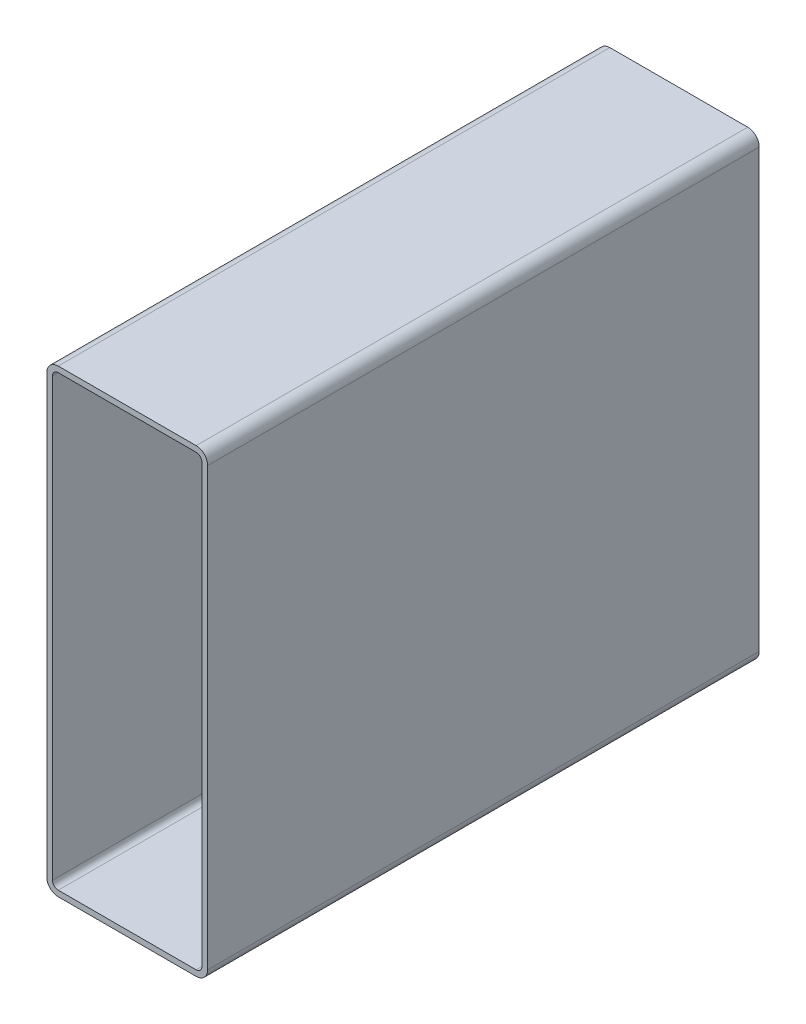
ISO-10303-21;
HEADER;
FILE_DESCRIPTION(('STEP AP214'),'2;1');
FILE_NAME('part.step','',(''),(''),'','','');
FILE_SCHEMA(('AUTOMOTIVE_DESIGN { 1 0 10303 214 1 1 1 1 }'));
ENDSEC;
DATA;
#1=APPLICATION_CONTEXT('core data for automotive mechanical design processes');
#2=APPLICATION_PROTOCOL_DEFINITION('international standard','automotive_design',2000,#1);
#3=PRODUCT_CONTEXT('',#1,'mechanical');
#4=PRODUCT('Part','Part','',(#3));
#5=PRODUCT_RELATED_PRODUCT_CATEGORY('part','',(#4));
#6=PRODUCT_DEFINITION_FORMATION('','',#4);
#7=PRODUCT_DEFINITION_CONTEXT('part definition',#1,'design');
#8=PRODUCT_DEFINITION('design','',#6,#7);
#9=PRODUCT_DEFINITION_SHAPE('','',#8);
#10=(LENGTH_UNIT() NAMED_UNIT(*) SI_UNIT(.MILLI.,.METRE.));
#11=(NAMED_UNIT(*) PLANE_ANGLE_UNIT() SI_UNIT($,.RADIAN.));
#12=(NAMED_UNIT(*) SI_UNIT($,.STERADIAN.) SOLID_ANGLE_UNIT());
#13=UNCERTAINTY_MEASURE_WITH_UNIT(LENGTH_MEASURE(1.E-05),#10,'distance_accuracy_value','');
#14=(GEOMETRIC_REPRESENTATION_CONTEXT(3) GLOBAL_UNCERTAINTY_ASSIGNED_CONTEXT((#13)) GLOBAL_UNIT_ASSIGNED_CONTEXT((#10,
#11,#12)) REPRESENTATION_CONTEXT('',''));
#15=CARTESIAN_POINT('',(0.,0.,0.));
#16=DIRECTION('',(0.,0.,1.));
#17=DIRECTION('',(1.,0.,0.));
#18=AXIS2_PLACEMENT_3D('',#15,#16,#17);
#19=CARTESIAN_POINT('',(8.43214692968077,249.570313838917,304.8));
#20=DIRECTION('',(0.,0.,1.));
#21=DIRECTION('',(1.,0.,0.));
#22=AXIS2_PLACEMENT_3D('',#19,#20,#21);
#23=PLANE('',#22);
#24=CARTESIAN_POINT('',(8.43214692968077,249.570313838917,304.8));
#25=DIRECTION('',(0.,0.,1.));
#26=DIRECTION('',(1.,0.,0.));
#27=AXIS2_PLACEMENT_3D('',#24,#25,#26);
#28=CIRCLE('',#27,6.35000000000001);
#29=CARTESIAN_POINT('',(8.43214692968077,255.920313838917,304.8));
#30=VERTEX_POINT('',#29);
#31=CARTESIAN_POINT('',(2.08214692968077,249.570313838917,304.8));
#32=VERTEX_POINT('',#31);
#33=EDGE_CURVE('E211',#30,#32,#28,.T.);
#34=ORIENTED_EDGE('',*,*,#33,.T.);
#35=DIRECTION('',(0.,-1.,0.));
#36=VECTOR('',#35,1.);
#37=CARTESIAN_POINT('',(2.08214692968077,8.27031383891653,304.8));
#38=LINE('',#37,#36);
#39=CARTESIAN_POINT('',(2.08214692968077,8.27031383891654,304.8));
#40=VERTEX_POINT('',#39);
#41=EDGE_CURVE('E214',#32,#40,#38,.T.);
#42=ORIENTED_EDGE('',*,*,#41,.T.);
#43=CARTESIAN_POINT('',(8.43214692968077,8.27031383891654,304.8));
#44=DIRECTION('',(0.,0.,1.));
#45=DIRECTION('',(1.,0.,0.));
#46=AXIS2_PLACEMENT_3D('',#43,#44,#45);
#47=CIRCLE('',#46,6.35);
#48=CARTESIAN_POINT('',(8.43214692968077,1.92031383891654,304.8));
#49=VERTEX_POINT('',#48);
#50=EDGE_CURVE('E217',#40,#49,#47,.T.);
#51=ORIENTED_EDGE('',*,*,#50,.T.);
#52=DIRECTION('',(1.,0.,0.));
#53=VECTOR('',#52,1.);
#54=CARTESIAN_POINT('',(84.6321469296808,1.92031383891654,304.8));
#55=LINE('',#54,#53);
#56=CARTESIAN_POINT('',(84.6321469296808,1.92031383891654,304.8));
#57=VERTEX_POINT('',#56);
#58=EDGE_CURVE('E219',#49,#57,#55,.T.);
#59=ORIENTED_EDGE('',*,*,#58,.T.);
#60=CARTESIAN_POINT('',(84.6321469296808,8.27031383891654,304.8));
#61=DIRECTION('',(0.,0.,1.));
#62=DIRECTION('',(1.,0.,0.));
#63=AXIS2_PLACEMENT_3D('',#60,#61,#62);
#64=CIRCLE('',#63,6.35);
#65=CARTESIAN_POINT('',(90.9821469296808,8.27031383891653,304.8));
#66=VERTEX_POINT('',#65);
#67=EDGE_CURVE('E221',#57,#66,#64,.T.);
#68=ORIENTED_EDGE('',*,*,#67,.T.);
#69=DIRECTION('',(0.,1.,0.));
#70=VECTOR('',#69,1.);
#71=CARTESIAN_POINT('',(90.9821469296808,249.570313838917,304.8));
#72=LINE('',#71,#70);
#73=CARTESIAN_POINT('',(90.9821469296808,249.570313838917,304.8));
#74=VERTEX_POINT('',#73);
#75=EDGE_CURVE('E223',#66,#74,#72,.T.);
#76=ORIENTED_EDGE('',*,*,#75,.T.);
#77=CARTESIAN_POINT('',(84.6321469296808,249.570313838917,304.8));
#78=DIRECTION('',(0.,0.,1.));
#79=DIRECTION('',(1.,0.,0.));
#80=AXIS2_PLACEMENT_3D('',#77,#78,#79);
#81=CIRCLE('',#80,6.35000000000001);
#82=CARTESIAN_POINT('',(84.6321469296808,255.920313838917,304.8));
#83=VERTEX_POINT('',#82);
#84=EDGE_CURVE('E225',#74,#83,#81,.T.);
#85=ORIENTED_EDGE('',*,*,#84,.T.);
#86=DIRECTION('',(-1.,0.,0.));
#87=VECTOR('',#86,1.);
#88=CARTESIAN_POINT('',(8.43214692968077,255.920313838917,304.8));
#89=LINE('',#88,#87);
#90=EDGE_CURVE('E227',#83,#30,#89,.T.);
#91=ORIENTED_EDGE('',*,*,#90,.T.);
#92=EDGE_LOOP('',(#34,#42,#51,#59,#68,#76,#85,#91));
#93=FACE_BOUND('',#92,.T.);
#94=DIRECTION('',(0.,-1.,0.));
#95=VECTOR('',#94,1.);
#96=CARTESIAN_POINT('',(5.25714692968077,8.27031383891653,304.8));
#97=LINE('',#96,#95);
#98=CARTESIAN_POINT('',(5.25714692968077,249.570313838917,304.8));
#99=VERTEX_POINT('',#98);
#100=CARTESIAN_POINT('',(5.25714692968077,8.27031383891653,304.8));
#101=VERTEX_POINT('',#100);
#102=EDGE_CURVE('E154',#99,#101,#97,.T.);
#103=ORIENTED_EDGE('',*,*,#102,.F.);
#104=CARTESIAN_POINT('',(8.43214692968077,249.570313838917,304.8));
#105=DIRECTION('',(0.,0.,1.));
#106=DIRECTION('',(1.,0.,0.));
#107=AXIS2_PLACEMENT_3D('',#104,#105,#106);
#108=CIRCLE('',#107,3.17499999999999);
#109=CARTESIAN_POINT('',(8.43214692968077,252.745313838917,304.8));
#110=VERTEX_POINT('',#109);
#111=EDGE_CURVE('E146',#110,#99,#108,.T.);
#112=ORIENTED_EDGE('',*,*,#111,.F.);
#113=DIRECTION('',(-1.,0.,0.));
#114=VECTOR('',#113,1.);
#115=CARTESIAN_POINT('',(8.43214692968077,252.745313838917,304.8));
#116=LINE('',#115,#114);
#117=CARTESIAN_POINT('',(84.6321469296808,252.745313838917,304.8));
#118=VERTEX_POINT('',#117);
#119=EDGE_CURVE('E179',#118,#110,#116,.T.);
#120=ORIENTED_EDGE('',*,*,#119,.F.);
#121=CARTESIAN_POINT('',(84.6321469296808,249.570313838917,304.8));
#122=DIRECTION('',(0.,0.,1.));
#123=DIRECTION('',(1.,0.,0.));
#124=AXIS2_PLACEMENT_3D('',#121,#122,#123);
#125=CIRCLE('',#124,3.17499999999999);
#126=CARTESIAN_POINT('',(87.8071469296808,249.570313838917,304.8));
#127=VERTEX_POINT('',#126);
#128=EDGE_CURVE('E177',#127,#118,#125,.T.);
#129=ORIENTED_EDGE('',*,*,#128,.F.);
#130=DIRECTION('',(0.,1.,0.));
#131=VECTOR('',#130,1.);
#132=CARTESIAN_POINT('',(87.8071469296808,249.570313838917,304.8));
#133=LINE('',#132,#131);
#134=CARTESIAN_POINT('',(87.8071469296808,8.27031383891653,304.8));
#135=VERTEX_POINT('',#134);
#136=EDGE_CURVE('E175',#135,#127,#133,.T.);
#137=ORIENTED_EDGE('',*,*,#136,.F.);
#138=CARTESIAN_POINT('',(84.6321469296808,8.27031383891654,304.8));
#139=DIRECTION('',(0.,0.,1.));
#140=DIRECTION('',(1.,0.,0.));
#141=AXIS2_PLACEMENT_3D('',#138,#139,#140);
#142=CIRCLE('',#141,3.175);
#143=CARTESIAN_POINT('',(84.6321469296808,5.09531383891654,304.8));
#144=VERTEX_POINT('',#143);
#145=EDGE_CURVE('E173',#144,#135,#142,.T.);
#146=ORIENTED_EDGE('',*,*,#145,.F.);
#147=DIRECTION('',(1.,0.,0.));
#148=VECTOR('',#147,1.);
#149=CARTESIAN_POINT('',(84.6321469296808,5.09531383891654,304.8));
#150=LINE('',#149,#148);
#151=CARTESIAN_POINT('',(8.43214692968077,5.09531383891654,304.8));
#152=VERTEX_POINT('',#151);
#153=EDGE_CURVE('E169',#152,#144,#150,.T.);
#154=ORIENTED_EDGE('',*,*,#153,.F.);
#155=CARTESIAN_POINT('',(8.43214692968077,8.27031383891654,304.8));
#156=DIRECTION('',(0.,0.,1.));
#157=DIRECTION('',(1.,0.,0.));
#158=AXIS2_PLACEMENT_3D('',#155,#156,#157);
#159=CIRCLE('',#158,3.175);
#160=EDGE_CURVE('E167',#101,#152,#159,.T.);
#161=ORIENTED_EDGE('',*,*,#160,.F.);
#162=EDGE_LOOP('',(#103,#112,#120,#129,#137,#146,#154,#161));
#163=FACE_BOUND('',#162,.T.);
#164=ADVANCED_FACE('F33',(#93,#163),#23,.T.);
#165=CARTESIAN_POINT('',(8.43214692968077,249.570313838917,0.));
#166=DIRECTION('',(0.,0.,1.));
#167=DIRECTION('',(1.,0.,0.));
#168=AXIS2_PLACEMENT_3D('',#165,#166,#167);
#169=PLANE('',#168);
#170=CARTESIAN_POINT('',(8.43214692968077,249.570313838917,0.));
#171=DIRECTION('',(0.,0.,1.));
#172=DIRECTION('',(1.,0.,0.));
#173=AXIS2_PLACEMENT_3D('',#170,#171,#172);
#174=CIRCLE('',#173,6.35000000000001);
#175=CARTESIAN_POINT('',(8.43214692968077,255.920313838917,0.));
#176=VERTEX_POINT('',#175);
#177=CARTESIAN_POINT('',(2.08214692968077,249.570313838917,0.));
#178=VERTEX_POINT('',#177);
#179=EDGE_CURVE('E162',#176,#178,#174,.T.);
#180=ORIENTED_EDGE('',*,*,#179,.F.);
#181=DIRECTION('',(-1.,0.,0.));
#182=VECTOR('',#181,1.);
#183=CARTESIAN_POINT('',(8.43214692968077,255.920313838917,0.));
#184=LINE('',#183,#182);
#185=CARTESIAN_POINT('',(84.6321469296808,255.920313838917,0.));
#186=VERTEX_POINT('',#185);
#187=EDGE_CURVE('E215',#186,#176,#184,.T.);
#188=ORIENTED_EDGE('',*,*,#187,.F.);
#189=CARTESIAN_POINT('',(84.6321469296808,249.570313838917,0.));
#190=DIRECTION('',(0.,0.,1.));
#191=DIRECTION('',(1.,0.,0.));
#192=AXIS2_PLACEMENT_3D('',#189,#190,#191);
#193=CIRCLE('',#192,6.35000000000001);
#194=CARTESIAN_POINT('',(90.9821469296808,249.570313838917,0.));
#195=VERTEX_POINT('',#194);
#196=EDGE_CURVE('E242',#195,#186,#193,.T.);
#197=ORIENTED_EDGE('',*,*,#196,.F.);
#198=DIRECTION('',(0.,1.,0.));
#199=VECTOR('',#198,1.);
#200=CARTESIAN_POINT('',(90.9821469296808,249.570313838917,0.));
#201=LINE('',#200,#199);
#202=CARTESIAN_POINT('',(90.9821469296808,8.27031383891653,0.));
#203=VERTEX_POINT('',#202);
#204=EDGE_CURVE('E240',#203,#195,#201,.T.);
#205=ORIENTED_EDGE('',*,*,#204,.F.);
#206=CARTESIAN_POINT('',(84.6321469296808,8.27031383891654,0.));
#207=DIRECTION('',(0.,0.,1.));
#208=DIRECTION('',(1.,0.,0.));
#209=AXIS2_PLACEMENT_3D('',#206,#207,#208);
#210=CIRCLE('',#209,6.35);
#211=CARTESIAN_POINT('',(84.6321469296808,1.92031383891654,0.));
#212=VERTEX_POINT('',#211);
#213=EDGE_CURVE('E238',#212,#203,#210,.T.);
#214=ORIENTED_EDGE('',*,*,#213,.F.);
#215=DIRECTION('',(1.,0.,0.));
#216=VECTOR('',#215,1.);
#217=CARTESIAN_POINT('',(84.6321469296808,1.92031383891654,0.));
#218=LINE('',#217,#216);
#219=CARTESIAN_POINT('',(8.43214692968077,1.92031383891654,0.));
#220=VERTEX_POINT('',#219);
#221=EDGE_CURVE('E236',#220,#212,#218,.T.);
#222=ORIENTED_EDGE('',*,*,#221,.F.);
#223=CARTESIAN_POINT('',(8.43214692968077,8.27031383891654,0.));
#224=DIRECTION('',(0.,0.,1.));
#225=DIRECTION('',(1.,0.,0.));
#226=AXIS2_PLACEMENT_3D('',#223,#224,#225);
#227=CIRCLE('',#226,6.35);
#228=CARTESIAN_POINT('',(2.08214692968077,8.27031383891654,0.));
#229=VERTEX_POINT('',#228);
#230=EDGE_CURVE('E234',#229,#220,#227,.T.);
#231=ORIENTED_EDGE('',*,*,#230,.F.);
#232=DIRECTION('',(0.,-1.,0.));
#233=VECTOR('',#232,1.);
#234=CARTESIAN_POINT('',(2.08214692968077,8.27031383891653,0.));
#235=LINE('',#234,#233);
#236=EDGE_CURVE('E232',#178,#229,#235,.T.);
#237=ORIENTED_EDGE('',*,*,#236,.F.);
#238=EDGE_LOOP('',(#180,#188,#197,#205,#214,#222,#231,#237));
#239=FACE_BOUND('',#238,.T.);
#240=CARTESIAN_POINT('',(8.43214692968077,249.570313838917,0.));
#241=DIRECTION('',(0.,0.,1.));
#242=DIRECTION('',(1.,0.,0.));
#243=AXIS2_PLACEMENT_3D('',#240,#241,#242);
#244=CIRCLE('',#243,3.17499999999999);
#245=CARTESIAN_POINT('',(8.43214692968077,252.745313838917,0.));
#246=VERTEX_POINT('',#245);
#247=CARTESIAN_POINT('',(5.25714692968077,249.570313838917,0.));
#248=VERTEX_POINT('',#247);
#249=EDGE_CURVE('E56',#246,#248,#244,.T.);
#250=ORIENTED_EDGE('',*,*,#249,.T.);
#251=DIRECTION('',(0.,-1.,0.));
#252=VECTOR('',#251,1.);
#253=CARTESIAN_POINT('',(5.25714692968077,8.27031383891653,0.));
#254=LINE('',#253,#252);
#255=CARTESIAN_POINT('',(5.25714692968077,8.27031383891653,0.));
#256=VERTEX_POINT('',#255);
#257=EDGE_CURVE('E161',#248,#256,#254,.T.);
#258=ORIENTED_EDGE('',*,*,#257,.T.);
#259=CARTESIAN_POINT('',(8.43214692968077,8.27031383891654,0.));
#260=DIRECTION('',(0.,0.,1.));
#261=DIRECTION('',(1.,0.,0.));
#262=AXIS2_PLACEMENT_3D('',#259,#260,#261);
#263=CIRCLE('',#262,3.175);
#264=CARTESIAN_POINT('',(8.43214692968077,5.09531383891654,0.));
#265=VERTEX_POINT('',#264);
#266=EDGE_CURVE('E183',#256,#265,#263,.T.);
#267=ORIENTED_EDGE('',*,*,#266,.T.);
#268=DIRECTION('',(1.,0.,0.));
#269=VECTOR('',#268,1.);
#270=CARTESIAN_POINT('',(84.6321469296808,5.09531383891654,0.));
#271=LINE('',#270,#269);
#272=CARTESIAN_POINT('',(84.6321469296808,5.09531383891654,0.));
#273=VERTEX_POINT('',#272);
#274=EDGE_CURVE('E186',#265,#273,#271,.T.);
#275=ORIENTED_EDGE('',*,*,#274,.T.);
#276=CARTESIAN_POINT('',(84.6321469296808,8.27031383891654,0.));
#277=DIRECTION('',(0.,0.,1.));
#278=DIRECTION('',(1.,0.,0.));
#279=AXIS2_PLACEMENT_3D('',#276,#277,#278);
#280=CIRCLE('',#279,3.175);
#281=CARTESIAN_POINT('',(87.8071469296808,8.27031383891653,0.));
#282=VERTEX_POINT('',#281);
#283=EDGE_CURVE('E189',#273,#282,#280,.T.);
#284=ORIENTED_EDGE('',*,*,#283,.T.);
#285=DIRECTION('',(0.,1.,0.));
#286=VECTOR('',#285,1.);
#287=CARTESIAN_POINT('',(87.8071469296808,249.570313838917,0.));
#288=LINE('',#287,#286);
#289=CARTESIAN_POINT('',(87.8071469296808,249.570313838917,0.));
#290=VERTEX_POINT('',#289);
#291=EDGE_CURVE('E192',#282,#290,#288,.T.);
#292=ORIENTED_EDGE('',*,*,#291,.T.);
#293=CARTESIAN_POINT('',(84.6321469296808,249.570313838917,0.));
#294=DIRECTION('',(0.,0.,1.));
#295=DIRECTION('',(1.,0.,0.));
#296=AXIS2_PLACEMENT_3D('',#293,#294,#295);
#297=CIRCLE('',#296,3.17499999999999);
#298=CARTESIAN_POINT('',(84.6321469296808,252.745313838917,0.));
#299=VERTEX_POINT('',#298);
#300=EDGE_CURVE('E195',#290,#299,#297,.T.);
#301=ORIENTED_EDGE('',*,*,#300,.T.);
#302=DIRECTION('',(-1.,0.,0.));
#303=VECTOR('',#302,1.);
#304=CARTESIAN_POINT('',(8.43214692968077,252.745313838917,0.));
#305=LINE('',#304,#303);
#306=EDGE_CURVE('E155',#299,#246,#305,.T.);
#307=ORIENTED_EDGE('',*,*,#306,.T.);
#308=EDGE_LOOP('',(#250,#258,#267,#275,#284,#292,#301,#307));
#309=FACE_BOUND('',#308,.T.);
#310=ADVANCED_FACE('F272',(#239,#309),#169,.F.);
#311=CARTESIAN_POINT('',(8.43214692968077,249.570313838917,304.8));
#312=DIRECTION('',(0.,0.,-1.));
#313=DIRECTION('',(-1.,0.,0.));
#314=AXIS2_PLACEMENT_3D('',#311,#312,#313);
#315=CYLINDRICAL_SURFACE('',#314,6.35000000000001);
#316=ORIENTED_EDGE('',*,*,#179,.T.);
#317=DIRECTION('',(0.,0.,-1.));
#318=VECTOR('',#317,1.);
#319=CARTESIAN_POINT('',(2.08214692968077,249.570313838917,304.8));
#320=LINE('',#319,#318);
#321=EDGE_CURVE('E11',#32,#178,#320,.T.);
#322=ORIENTED_EDGE('',*,*,#321,.F.);
#323=ORIENTED_EDGE('',*,*,#33,.F.);
#324=DIRECTION('',(0.,0.,-1.));
#325=VECTOR('',#324,1.);
#326=CARTESIAN_POINT('',(8.43214692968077,255.920313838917,304.8));
#327=LINE('',#326,#325);
#328=EDGE_CURVE('E229',#30,#176,#327,.T.);
#329=ORIENTED_EDGE('',*,*,#328,.T.);
#330=EDGE_LOOP('',(#316,#322,#323,#329));
#331=FACE_BOUND('',#330,.T.);
#332=ADVANCED_FACE('F35',(#331),#315,.T.);
#333=CARTESIAN_POINT('',(2.08214692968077,8.27031383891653,304.8));
#334=DIRECTION('',(1.,0.,0.));
#335=DIRECTION('',(0.,0.,-1.));
#336=AXIS2_PLACEMENT_3D('',#333,#334,#335);
#337=PLANE('',#336);
#338=ORIENTED_EDGE('',*,*,#236,.T.);
#339=DIRECTION('',(0.,0.,-1.));
#340=VECTOR('',#339,1.);
#341=CARTESIAN_POINT('',(2.08214692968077,8.27031383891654,304.8));
#342=LINE('',#341,#340);
#343=EDGE_CURVE('E41',#40,#229,#342,.T.);
#344=ORIENTED_EDGE('',*,*,#343,.F.);
#345=ORIENTED_EDGE('',*,*,#41,.F.);
#346=ORIENTED_EDGE('',*,*,#321,.T.);
#347=EDGE_LOOP('',(#338,#344,#345,#346));
#348=FACE_BOUND('',#347,.T.);
#349=ADVANCED_FACE('F289',(#348),#337,.F.);
#350=CARTESIAN_POINT('',(8.43214692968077,8.27031383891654,304.8));
#351=DIRECTION('',(0.,0.,-1.));
#352=DIRECTION('',(-1.,0.,0.));
#353=AXIS2_PLACEMENT_3D('',#350,#351,#352);
#354=CYLINDRICAL_SURFACE('',#353,6.35);
#355=ORIENTED_EDGE('',*,*,#230,.T.);
#356=DIRECTION('',(0.,0.,-1.));
#357=VECTOR('',#356,1.);
#358=CARTESIAN_POINT('',(8.43214692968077,1.92031383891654,304.8));
#359=LINE('',#358,#357);
#360=EDGE_CURVE('E259',#49,#220,#359,.T.);
#361=ORIENTED_EDGE('',*,*,#360,.F.);
#362=ORIENTED_EDGE('',*,*,#50,.F.);
#363=ORIENTED_EDGE('',*,*,#343,.T.);
#364=EDGE_LOOP('',(#355,#361,#362,#363));
#365=FACE_BOUND('',#364,.T.);
#366=ADVANCED_FACE('F266',(#365),#354,.T.);
#367=CARTESIAN_POINT('',(84.6321469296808,1.92031383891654,304.8));
#368=DIRECTION('',(0.,1.,0.));
#369=DIRECTION('',(0.,0.,1.));
#370=AXIS2_PLACEMENT_3D('',#367,#368,#369);
#371=PLANE('',#370);
#372=ORIENTED_EDGE('',*,*,#221,.T.);
#373=DIRECTION('',(0.,0.,-1.));
#374=VECTOR('',#373,1.);
#375=CARTESIAN_POINT('',(84.6321469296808,1.92031383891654,304.8));
#376=LINE('',#375,#374);
#377=EDGE_CURVE('E256',#57,#212,#376,.T.);
#378=ORIENTED_EDGE('',*,*,#377,.F.);
#379=ORIENTED_EDGE('',*,*,#58,.F.);
#380=ORIENTED_EDGE('',*,*,#360,.T.);
#381=EDGE_LOOP('',(#372,#378,#379,#380));
#382=FACE_BOUND('',#381,.T.);
#383=ADVANCED_FACE('F278',(#382),#371,.F.);
#384=CARTESIAN_POINT('',(84.6321469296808,8.27031383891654,304.8));
#385=DIRECTION('',(0.,0.,-1.));
#386=DIRECTION('',(-1.,0.,0.));
#387=AXIS2_PLACEMENT_3D('',#384,#385,#386);
#388=CYLINDRICAL_SURFACE('',#387,6.35);
#389=ORIENTED_EDGE('',*,*,#213,.T.);
#390=DIRECTION('',(0.,0.,-1.));
#391=VECTOR('',#390,1.);
#392=CARTESIAN_POINT('',(90.9821469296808,8.27031383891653,304.8));
#393=LINE('',#392,#391);
#394=EDGE_CURVE('E253',#66,#203,#393,.T.);
#395=ORIENTED_EDGE('',*,*,#394,.F.);
#396=ORIENTED_EDGE('',*,*,#67,.F.);
#397=ORIENTED_EDGE('',*,*,#377,.T.);
#398=EDGE_LOOP('',(#389,#395,#396,#397));
#399=FACE_BOUND('',#398,.T.);
#400=ADVANCED_FACE('F282',(#399),#388,.T.);
#401=CARTESIAN_POINT('',(90.9821469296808,249.570313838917,304.8));
#402=DIRECTION('',(-1.,0.,0.));
#403=DIRECTION('',(0.,0.,1.));
#404=AXIS2_PLACEMENT_3D('',#401,#402,#403);
#405=PLANE('',#404);
#406=ORIENTED_EDGE('',*,*,#204,.T.);
#407=DIRECTION('',(0.,0.,-1.));
#408=VECTOR('',#407,1.);
#409=CARTESIAN_POINT('',(90.9821469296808,249.570313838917,304.8));
#410=LINE('',#409,#408);
#411=EDGE_CURVE('E250',#74,#195,#410,.T.);
#412=ORIENTED_EDGE('',*,*,#411,.F.);
#413=ORIENTED_EDGE('',*,*,#75,.F.);
#414=ORIENTED_EDGE('',*,*,#394,.T.);
#415=EDGE_LOOP('',(#406,#412,#413,#414));
#416=FACE_BOUND('',#415,.T.);
#417=ADVANCED_FACE('F302',(#416),#405,.F.);
#418=CARTESIAN_POINT('',(84.6321469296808,249.570313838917,304.8));
#419=DIRECTION('',(0.,0.,-1.));
#420=DIRECTION('',(-1.,0.,0.));
#421=AXIS2_PLACEMENT_3D('',#418,#419,#420);
#422=CYLINDRICAL_SURFACE('',#421,6.35000000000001);
#423=ORIENTED_EDGE('',*,*,#196,.T.);
#424=DIRECTION('',(0.,0.,-1.));
#425=VECTOR('',#424,1.);
#426=CARTESIAN_POINT('',(84.6321469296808,255.920313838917,304.8));
#427=LINE('',#426,#425);
#428=EDGE_CURVE('E247',#83,#186,#427,.T.);
#429=ORIENTED_EDGE('',*,*,#428,.F.);
#430=ORIENTED_EDGE('',*,*,#84,.F.);
#431=ORIENTED_EDGE('',*,*,#411,.T.);
#432=EDGE_LOOP('',(#423,#429,#430,#431));
#433=FACE_BOUND('',#432,.T.);
#434=ADVANCED_FACE('F300',(#433),#422,.T.);
#435=CARTESIAN_POINT('',(8.43214692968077,255.920313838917,304.8));
#436=DIRECTION('',(0.,-1.,0.));
#437=DIRECTION('',(0.,0.,-1.));
#438=AXIS2_PLACEMENT_3D('',#435,#436,#437);
#439=PLANE('',#438);
#440=ORIENTED_EDGE('',*,*,#187,.T.);
#441=ORIENTED_EDGE('',*,*,#328,.F.);
#442=ORIENTED_EDGE('',*,*,#90,.F.);
#443=ORIENTED_EDGE('',*,*,#428,.T.);
#444=EDGE_LOOP('',(#440,#441,#442,#443));
#445=FACE_BOUND('',#444,.T.);
#446=ADVANCED_FACE('F295',(#445),#439,.F.);
#447=CARTESIAN_POINT('',(8.43214692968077,249.570313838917,304.8));
#448=DIRECTION('',(0.,0.,-1.));
#449=DIRECTION('',(-1.,0.,0.));
#450=AXIS2_PLACEMENT_3D('',#447,#448,#449);
#451=CYLINDRICAL_SURFACE('',#450,3.17499999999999);
#452=ORIENTED_EDGE('',*,*,#249,.F.);
#453=DIRECTION('',(0.,0.,-1.));
#454=VECTOR('',#453,1.);
#455=CARTESIAN_POINT('',(8.43214692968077,252.745313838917,304.8));
#456=LINE('',#455,#454);
#457=EDGE_CURVE('E150',#110,#246,#456,.T.);
#458=ORIENTED_EDGE('',*,*,#457,.F.);
#459=ORIENTED_EDGE('',*,*,#111,.T.);
#460=DIRECTION('',(0.,0.,-1.));
#461=VECTOR('',#460,1.);
#462=CARTESIAN_POINT('',(5.25714692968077,249.570313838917,304.8));
#463=LINE('',#462,#461);
#464=EDGE_CURVE('E149',#99,#248,#463,.T.);
#465=ORIENTED_EDGE('',*,*,#464,.T.);
#466=EDGE_LOOP('',(#452,#458,#459,#465));
#467=FACE_BOUND('',#466,.T.);
#468=ADVANCED_FACE('F148',(#467),#451,.F.);
#469=CARTESIAN_POINT('',(5.25714692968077,8.27031383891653,304.8));
#470=DIRECTION('',(1.,0.,0.));
#471=DIRECTION('',(0.,0.,-1.));
#472=AXIS2_PLACEMENT_3D('',#469,#470,#471);
#473=PLANE('',#472);
#474=ORIENTED_EDGE('',*,*,#257,.F.);
#475=ORIENTED_EDGE('',*,*,#464,.F.);
#476=ORIENTED_EDGE('',*,*,#102,.T.);
#477=DIRECTION('',(0.,0.,-1.));
#478=VECTOR('',#477,1.);
#479=CARTESIAN_POINT('',(5.25714692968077,8.27031383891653,304.8));
#480=LINE('',#479,#478);
#481=EDGE_CURVE('E163',#101,#256,#480,.T.);
#482=ORIENTED_EDGE('',*,*,#481,.T.);
#483=EDGE_LOOP('',(#474,#475,#476,#482));
#484=FACE_BOUND('',#483,.T.);
#485=ADVANCED_FACE('F158',(#484),#473,.T.);
#486=CARTESIAN_POINT('',(8.43214692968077,8.27031383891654,304.8));
#487=DIRECTION('',(0.,0.,-1.));
#488=DIRECTION('',(-1.,0.,0.));
#489=AXIS2_PLACEMENT_3D('',#486,#487,#488);
#490=CYLINDRICAL_SURFACE('',#489,3.175);
#491=ORIENTED_EDGE('',*,*,#266,.F.);
#492=ORIENTED_EDGE('',*,*,#481,.F.);
#493=ORIENTED_EDGE('',*,*,#160,.T.);
#494=DIRECTION('',(0.,0.,-1.));
#495=VECTOR('',#494,1.);
#496=CARTESIAN_POINT('',(8.43214692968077,5.09531383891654,304.8));
#497=LINE('',#496,#495);
#498=EDGE_CURVE('E208',#152,#265,#497,.T.);
#499=ORIENTED_EDGE('',*,*,#498,.T.);
#500=EDGE_LOOP('',(#491,#492,#493,#499));
#501=FACE_BOUND('',#500,.T.);
#502=ADVANCED_FACE('F327',(#501),#490,.F.);
#503=CARTESIAN_POINT('',(84.6321469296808,5.09531383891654,304.8));
#504=DIRECTION('',(0.,1.,0.));
#505=DIRECTION('',(0.,0.,1.));
#506=AXIS2_PLACEMENT_3D('',#503,#504,#505);
#507=PLANE('',#506);
#508=ORIENTED_EDGE('',*,*,#274,.F.);
#509=ORIENTED_EDGE('',*,*,#498,.F.);
#510=ORIENTED_EDGE('',*,*,#153,.T.);
#511=DIRECTION('',(0.,0.,-1.));
#512=VECTOR('',#511,1.);
#513=CARTESIAN_POINT('',(84.6321469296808,5.09531383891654,304.8));
#514=LINE('',#513,#512);
#515=EDGE_CURVE('E206',#144,#273,#514,.T.);
#516=ORIENTED_EDGE('',*,*,#515,.T.);
#517=EDGE_LOOP('',(#508,#509,#510,#516));
#518=FACE_BOUND('',#517,.T.);
#519=ADVANCED_FACE('F331',(#518),#507,.T.);
#520=CARTESIAN_POINT('',(84.6321469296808,8.27031383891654,304.8));
#521=DIRECTION('',(0.,0.,-1.));
#522=DIRECTION('',(-1.,0.,0.));
#523=AXIS2_PLACEMENT_3D('',#520,#521,#522);
#524=CYLINDRICAL_SURFACE('',#523,3.175);
#525=ORIENTED_EDGE('',*,*,#283,.F.);
#526=ORIENTED_EDGE('',*,*,#515,.F.);
#527=ORIENTED_EDGE('',*,*,#145,.T.);
#528=DIRECTION('',(0.,0.,-1.));
#529=VECTOR('',#528,1.);
#530=CARTESIAN_POINT('',(87.8071469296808,8.27031383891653,304.8));
#531=LINE('',#530,#529);
#532=EDGE_CURVE('E204',#135,#282,#531,.T.);
#533=ORIENTED_EDGE('',*,*,#532,.T.);
#534=EDGE_LOOP('',(#525,#526,#527,#533));
#535=FACE_BOUND('',#534,.T.);
#536=ADVANCED_FACE('F337',(#535),#524,.F.);
#537=CARTESIAN_POINT('',(87.8071469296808,249.570313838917,304.8));
#538=DIRECTION('',(-1.,0.,0.));
#539=DIRECTION('',(0.,0.,1.));
#540=AXIS2_PLACEMENT_3D('',#537,#538,#539);
#541=PLANE('',#540);
#542=ORIENTED_EDGE('',*,*,#291,.F.);
#543=ORIENTED_EDGE('',*,*,#532,.F.);
#544=ORIENTED_EDGE('',*,*,#136,.T.);
#545=DIRECTION('',(0.,0.,-1.));
#546=VECTOR('',#545,1.);
#547=CARTESIAN_POINT('',(87.8071469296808,249.570313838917,304.8));
#548=LINE('',#547,#546);
#549=EDGE_CURVE('E202',#127,#290,#548,.T.);
#550=ORIENTED_EDGE('',*,*,#549,.T.);
#551=EDGE_LOOP('',(#542,#543,#544,#550));
#552=FACE_BOUND('',#551,.T.);
#553=ADVANCED_FACE('F341',(#552),#541,.T.);
#554=CARTESIAN_POINT('',(84.6321469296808,249.570313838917,304.8));
#555=DIRECTION('',(0.,0.,-1.));
#556=DIRECTION('',(-1.,0.,0.));
#557=AXIS2_PLACEMENT_3D('',#554,#555,#556);
#558=CYLINDRICAL_SURFACE('',#557,3.17499999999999);
#559=ORIENTED_EDGE('',*,*,#300,.F.);
#560=ORIENTED_EDGE('',*,*,#549,.F.);
#561=ORIENTED_EDGE('',*,*,#128,.T.);
#562=DIRECTION('',(0.,0.,-1.));
#563=VECTOR('',#562,1.);
#564=CARTESIAN_POINT('',(84.6321469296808,252.745313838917,304.8));
#565=LINE('',#564,#563);
#566=EDGE_CURVE('E48',#118,#299,#565,.T.);
#567=ORIENTED_EDGE('',*,*,#566,.T.);
#568=EDGE_LOOP('',(#559,#560,#561,#567));
#569=FACE_BOUND('',#568,.T.);
#570=ADVANCED_FACE('F345',(#569),#558,.F.);
#571=CARTESIAN_POINT('',(8.43214692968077,252.745313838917,304.8));
#572=DIRECTION('',(0.,-1.,0.));
#573=DIRECTION('',(0.,0.,-1.));
#574=AXIS2_PLACEMENT_3D('',#571,#572,#573);
#575=PLANE('',#574);
#576=ORIENTED_EDGE('',*,*,#306,.F.);
#577=ORIENTED_EDGE('',*,*,#566,.F.);
#578=ORIENTED_EDGE('',*,*,#119,.T.);
#579=ORIENTED_EDGE('',*,*,#457,.T.);
#580=EDGE_LOOP('',(#576,#577,#578,#579));
#581=FACE_BOUND('',#580,.T.);
#582=ADVANCED_FACE('F349',(#581),#575,.T.);
#583=CLOSED_SHELL('',(#164,#310,#332,#349,#366,#383,#400,#417,#434,#446,#468,#485,#502,#519,
#536,#553,#570,#582));
#584=MANIFOLD_SOLID_BREP('B2',#583);
#585=ADVANCED_BREP_SHAPE_REPRESENTATION('',(#18,#584),#14);
#586=SHAPE_DEFINITION_REPRESENTATION(#9,#585);
ENDSEC;
END-ISO-10303-21;
